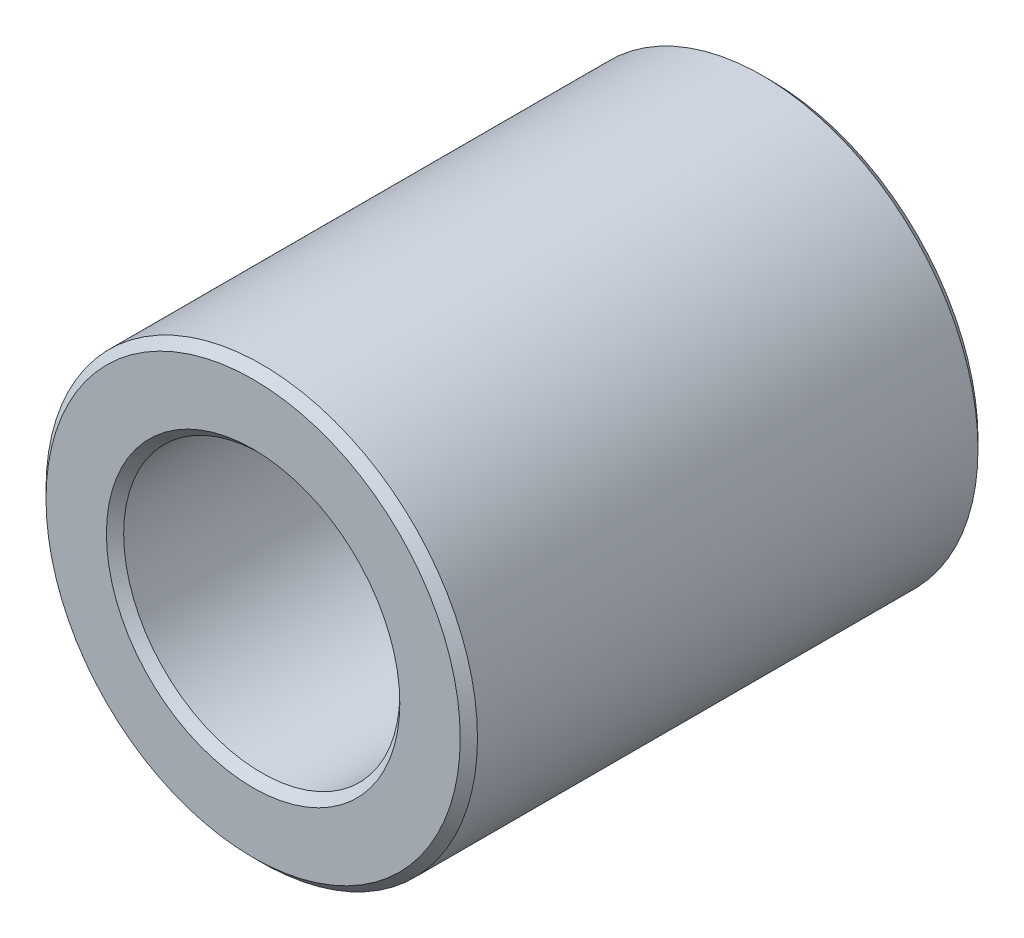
ISO-10303-21;
HEADER;
FILE_DESCRIPTION(('STEP AP214'),'2;1');
FILE_NAME('part.step','',(''),(''),'','','');
FILE_SCHEMA(('AUTOMOTIVE_DESIGN { 1 0 10303 214 1 1 1 1 }'));
ENDSEC;
DATA;
#1=APPLICATION_CONTEXT('core data for automotive mechanical design processes');
#2=APPLICATION_PROTOCOL_DEFINITION('international standard','automotive_design',2000,#1);
#3=PRODUCT_CONTEXT('',#1,'mechanical');
#4=PRODUCT('Part','Part','',(#3));
#5=PRODUCT_RELATED_PRODUCT_CATEGORY('part','',(#4));
#6=PRODUCT_DEFINITION_FORMATION('','',#4);
#7=PRODUCT_DEFINITION_CONTEXT('part definition',#1,'design');
#8=PRODUCT_DEFINITION('design','',#6,#7);
#9=PRODUCT_DEFINITION_SHAPE('','',#8);
#10=(LENGTH_UNIT() NAMED_UNIT(*) SI_UNIT(.MILLI.,.METRE.));
#11=(NAMED_UNIT(*) PLANE_ANGLE_UNIT() SI_UNIT($,.RADIAN.));
#12=(NAMED_UNIT(*) SI_UNIT($,.STERADIAN.) SOLID_ANGLE_UNIT());
#13=UNCERTAINTY_MEASURE_WITH_UNIT(LENGTH_MEASURE(1.E-05),#10,'distance_accuracy_value','');
#14=(GEOMETRIC_REPRESENTATION_CONTEXT(3) GLOBAL_UNCERTAINTY_ASSIGNED_CONTEXT((#13)) GLOBAL_UNIT_ASSIGNED_CONTEXT((#10,
#11,#12)) REPRESENTATION_CONTEXT('',''));
#15=CARTESIAN_POINT('',(0.,0.,0.));
#16=DIRECTION('',(0.,0.,1.));
#17=DIRECTION('',(1.,0.,0.));
#18=AXIS2_PLACEMENT_3D('',#15,#16,#17);
#19=CARTESIAN_POINT('',(0.,0.,6.));
#20=DIRECTION('',(0.,0.,1.));
#21=DIRECTION('',(1.,0.,0.));
#22=AXIS2_PLACEMENT_3D('',#19,#20,#21);
#23=PLANE('',#22);
#24=CARTESIAN_POINT('',(0.,0.,6.));
#25=DIRECTION('',(0.,0.,1.));
#26=DIRECTION('',(1.,0.,0.));
#27=AXIS2_PLACEMENT_3D('',#24,#25,#26);
#28=CIRCLE('',#27,3.4);
#29=CARTESIAN_POINT('',(3.4,0.,6.));
#30=VERTEX_POINT('',#29);
#31=EDGE_CURVE('E10',#30,#30,#28,.F.);
#32=ORIENTED_EDGE('',*,*,#31,.T.);
#33=EDGE_LOOP('',(#32));
#34=FACE_BOUND('',#33,.T.);
#35=CARTESIAN_POINT('',(0.,0.,6.));
#36=DIRECTION('',(0.,0.,1.));
#37=DIRECTION('',(1.,0.,0.));
#38=AXIS2_PLACEMENT_3D('',#35,#36,#37);
#39=CIRCLE('',#38,4.80000000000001);
#40=CARTESIAN_POINT('',(4.80000000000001,0.,6.));
#41=VERTEX_POINT('',#40);
#42=EDGE_CURVE('E45',#41,#41,#39,.T.);
#43=ORIENTED_EDGE('',*,*,#42,.T.);
#44=EDGE_LOOP('',(#43));
#45=FACE_BOUND('',#44,.T.);
#46=ADVANCED_FACE('F37',(#34,#45),#23,.T.);
#47=CARTESIAN_POINT('',(0.,0.,-6.));
#48=DIRECTION('',(0.,0.,1.));
#49=DIRECTION('',(1.,0.,0.));
#50=AXIS2_PLACEMENT_3D('',#47,#48,#49);
#51=PLANE('',#50);
#52=CARTESIAN_POINT('',(0.,0.,-6.));
#53=DIRECTION('',(0.,0.,1.));
#54=DIRECTION('',(1.,0.,0.));
#55=AXIS2_PLACEMENT_3D('',#52,#53,#54);
#56=CIRCLE('',#55,4.8);
#57=CARTESIAN_POINT('',(4.8,0.,-6.));
#58=VERTEX_POINT('',#57);
#59=EDGE_CURVE('E64',#58,#58,#56,.F.);
#60=ORIENTED_EDGE('',*,*,#59,.T.);
#61=EDGE_LOOP('',(#60));
#62=FACE_BOUND('',#61,.T.);
#63=CARTESIAN_POINT('',(0.,0.,-6.));
#64=DIRECTION('',(0.,0.,1.));
#65=DIRECTION('',(1.,0.,0.));
#66=AXIS2_PLACEMENT_3D('',#63,#64,#65);
#67=CIRCLE('',#66,3.4);
#68=CARTESIAN_POINT('',(3.4,0.,-6.));
#69=VERTEX_POINT('',#68);
#70=EDGE_CURVE('E67',#69,#69,#67,.T.);
#71=ORIENTED_EDGE('',*,*,#70,.T.);
#72=EDGE_LOOP('',(#71));
#73=FACE_BOUND('',#72,.T.);
#74=ADVANCED_FACE('F89',(#62,#73),#51,.F.);
#75=CARTESIAN_POINT('',(0.,0.,6.));
#76=DIRECTION('',(0.,0.,-1.));
#77=DIRECTION('',(-1.,0.,0.));
#78=AXIS2_PLACEMENT_3D('',#75,#76,#77);
#79=CYLINDRICAL_SURFACE('',#78,5.);
#80=CARTESIAN_POINT('',(0.,0.,-5.80000000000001));
#81=DIRECTION('',(0.,0.,1.));
#82=DIRECTION('',(1.,0.,0.));
#83=AXIS2_PLACEMENT_3D('',#80,#81,#82);
#84=CIRCLE('',#83,5.);
#85=CARTESIAN_POINT('',(5.,0.,-5.80000000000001));
#86=VERTEX_POINT('',#85);
#87=EDGE_CURVE('E70',#86,#86,#84,.T.);
#88=ORIENTED_EDGE('',*,*,#87,.T.);
#89=EDGE_LOOP('',(#88));
#90=FACE_BOUND('',#89,.T.);
#91=CARTESIAN_POINT('',(0.,0.,5.8));
#92=DIRECTION('',(0.,0.,1.));
#93=DIRECTION('',(1.,0.,0.));
#94=AXIS2_PLACEMENT_3D('',#91,#92,#93);
#95=CIRCLE('',#94,5.);
#96=CARTESIAN_POINT('',(5.,0.,5.8));
#97=VERTEX_POINT('',#96);
#98=EDGE_CURVE('E74',#97,#97,#95,.F.);
#99=ORIENTED_EDGE('',*,*,#98,.T.);
#100=EDGE_LOOP('',(#99));
#101=FACE_BOUND('',#100,.T.);
#102=ADVANCED_FACE('F78',(#90,#101),#79,.T.);
#103=CARTESIAN_POINT('',(0.,0.,6.));
#104=DIRECTION('',(0.,0.,-1.));
#105=DIRECTION('',(-1.,0.,0.));
#106=AXIS2_PLACEMENT_3D('',#103,#104,#105);
#107=CYLINDRICAL_SURFACE('',#106,3.2);
#108=CARTESIAN_POINT('',(0.,0.,-5.8));
#109=DIRECTION('',(0.,0.,1.));
#110=DIRECTION('',(1.,0.,0.));
#111=AXIS2_PLACEMENT_3D('',#108,#109,#110);
#112=CIRCLE('',#111,3.2);
#113=CARTESIAN_POINT('',(3.2,0.,-5.8));
#114=VERTEX_POINT('',#113);
#115=EDGE_CURVE('E51',#114,#114,#112,.F.);
#116=ORIENTED_EDGE('',*,*,#115,.T.);
#117=EDGE_LOOP('',(#116));
#118=FACE_BOUND('',#117,.T.);
#119=CARTESIAN_POINT('',(0.,0.,5.80000000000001));
#120=DIRECTION('',(0.,0.,1.));
#121=DIRECTION('',(1.,0.,0.));
#122=AXIS2_PLACEMENT_3D('',#119,#120,#121);
#123=CIRCLE('',#122,3.2);
#124=CARTESIAN_POINT('',(3.2,0.,5.80000000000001));
#125=VERTEX_POINT('',#124);
#126=EDGE_CURVE('E58',#125,#125,#123,.T.);
#127=ORIENTED_EDGE('',*,*,#126,.T.);
#128=EDGE_LOOP('',(#127));
#129=FACE_BOUND('',#128,.T.);
#130=ADVANCED_FACE('F97',(#118,#129),#107,.F.);
#131=CARTESIAN_POINT('',(0.,0.,-5.80000000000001));
#132=DIRECTION('',(0.,0.,1.));
#133=DIRECTION('',(1.,0.,0.));
#134=AXIS2_PLACEMENT_3D('',#131,#132,#133);
#135=CONICAL_SURFACE('',#134,5.,0.785398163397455);
#136=ORIENTED_EDGE('',*,*,#59,.F.);
#137=EDGE_LOOP('',(#136));
#138=FACE_BOUND('',#137,.T.);
#139=ORIENTED_EDGE('',*,*,#87,.F.);
#140=EDGE_LOOP('',(#139));
#141=FACE_BOUND('',#140,.T.);
#142=ADVANCED_FACE('F102',(#138,#141),#135,.T.);
#143=CARTESIAN_POINT('',(0.,0.,-6.));
#144=DIRECTION('',(0.,0.,-1.));
#145=DIRECTION('',(-1.,0.,0.));
#146=AXIS2_PLACEMENT_3D('',#143,#144,#145);
#147=CONICAL_SURFACE('',#146,3.4,0.785398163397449);
#148=ORIENTED_EDGE('',*,*,#115,.F.);
#149=EDGE_LOOP('',(#148));
#150=FACE_BOUND('',#149,.T.);
#151=ORIENTED_EDGE('',*,*,#70,.F.);
#152=EDGE_LOOP('',(#151));
#153=FACE_BOUND('',#152,.T.);
#154=ADVANCED_FACE('F86',(#150,#153),#147,.F.);
#155=CARTESIAN_POINT('',(0.,0.,5.80000000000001));
#156=DIRECTION('',(0.,0.,1.));
#157=DIRECTION('',(1.,0.,0.));
#158=AXIS2_PLACEMENT_3D('',#155,#156,#157);
#159=CONICAL_SURFACE('',#158,3.2,0.785398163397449);
#160=ORIENTED_EDGE('',*,*,#31,.F.);
#161=EDGE_LOOP('',(#160));
#162=FACE_BOUND('',#161,.T.);
#163=ORIENTED_EDGE('',*,*,#126,.F.);
#164=EDGE_LOOP('',(#163));
#165=FACE_BOUND('',#164,.T.);
#166=ADVANCED_FACE('F82',(#162,#165),#159,.F.);
#167=CARTESIAN_POINT('',(0.,0.,6.));
#168=DIRECTION('',(0.,0.,-1.));
#169=DIRECTION('',(-1.,0.,0.));
#170=AXIS2_PLACEMENT_3D('',#167,#168,#169);
#171=CONICAL_SURFACE('',#170,4.80000000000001,0.785398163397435);
#172=ORIENTED_EDGE('',*,*,#98,.F.);
#173=EDGE_LOOP('',(#172));
#174=FACE_BOUND('',#173,.T.);
#175=ORIENTED_EDGE('',*,*,#42,.F.);
#176=EDGE_LOOP('',(#175));
#177=FACE_BOUND('',#176,.T.);
#178=ADVANCED_FACE('F39',(#174,#177),#171,.T.);
#179=CLOSED_SHELL('',(#46,#74,#102,#130,#142,#154,#166,#178));
#180=MANIFOLD_SOLID_BREP('B2',#179);
#181=ADVANCED_BREP_SHAPE_REPRESENTATION('',(#18,#180),#14);
#182=SHAPE_DEFINITION_REPRESENTATION(#9,#181);
ENDSEC;
END-ISO-10303-21;
